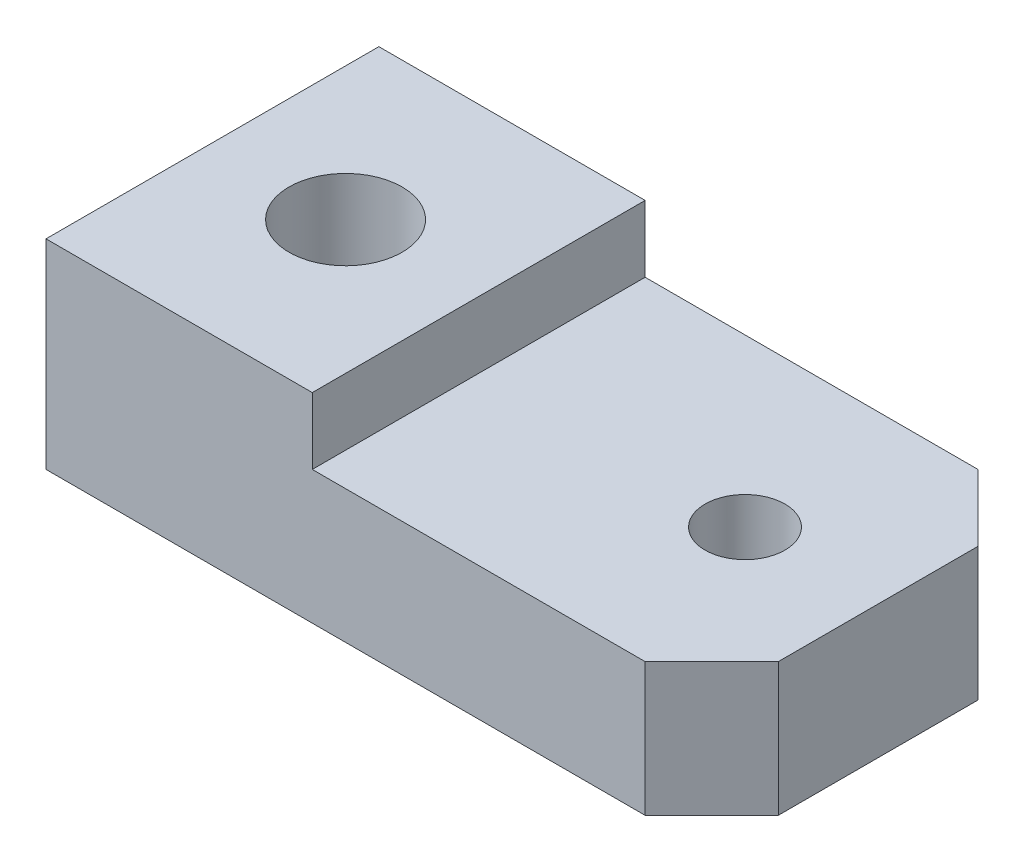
ISO-10303-21;
HEADER;
FILE_DESCRIPTION(('STEP AP214'),'2;1');
FILE_NAME('part.step','',(''),(''),'','','');
FILE_SCHEMA(('AUTOMOTIVE_DESIGN { 1 0 10303 214 1 1 1 1 }'));
ENDSEC;
DATA;
#1=APPLICATION_CONTEXT('core data for automotive mechanical design processes');
#2=APPLICATION_PROTOCOL_DEFINITION('international standard','automotive_design',2000,#1);
#3=PRODUCT_CONTEXT('',#1,'mechanical');
#4=PRODUCT('Part','Part','',(#3));
#5=PRODUCT_RELATED_PRODUCT_CATEGORY('part','',(#4));
#6=PRODUCT_DEFINITION_FORMATION('','',#4);
#7=PRODUCT_DEFINITION_CONTEXT('part definition',#1,'design');
#8=PRODUCT_DEFINITION('design','',#6,#7);
#9=PRODUCT_DEFINITION_SHAPE('','',#8);
#10=(LENGTH_UNIT() NAMED_UNIT(*) SI_UNIT(.MILLI.,.METRE.));
#11=(NAMED_UNIT(*) PLANE_ANGLE_UNIT() SI_UNIT($,.RADIAN.));
#12=(NAMED_UNIT(*) SI_UNIT($,.STERADIAN.) SOLID_ANGLE_UNIT());
#13=UNCERTAINTY_MEASURE_WITH_UNIT(LENGTH_MEASURE(1.E-05),#10,'distance_accuracy_value','');
#14=(GEOMETRIC_REPRESENTATION_CONTEXT(3) GLOBAL_UNCERTAINTY_ASSIGNED_CONTEXT((#13)) GLOBAL_UNIT_ASSIGNED_CONTEXT((#10,
#11,#12)) REPRESENTATION_CONTEXT('',''));
#15=CARTESIAN_POINT('',(0.,0.,0.));
#16=DIRECTION('',(0.,0.,1.));
#17=DIRECTION('',(1.,0.,0.));
#18=AXIS2_PLACEMENT_3D('',#15,#16,#17);
#19=CARTESIAN_POINT('',(-50.,15.,25.));
#20=DIRECTION('',(1.,0.,0.));
#21=DIRECTION('',(0.,0.,-1.));
#22=AXIS2_PLACEMENT_3D('',#19,#20,#21);
#23=PLANE('',#22);
#24=DIRECTION('',(0.,-1.,0.));
#25=VECTOR('',#24,1.);
#26=CARTESIAN_POINT('',(-50.,15.,0.));
#27=LINE('',#26,#25);
#28=CARTESIAN_POINT('',(-50.,15.,0.));
#29=VERTEX_POINT('',#28);
#30=CARTESIAN_POINT('',(-50.,0.,0.));
#31=VERTEX_POINT('',#30);
#32=EDGE_CURVE('E95',#29,#31,#27,.T.);
#33=ORIENTED_EDGE('',*,*,#32,.T.);
#34=DIRECTION('',(0.,0.,-1.));
#35=VECTOR('',#34,1.);
#36=CARTESIAN_POINT('',(-50.,0.,25.));
#37=LINE('',#36,#35);
#38=CARTESIAN_POINT('',(-50.,0.,25.));
#39=VERTEX_POINT('',#38);
#40=EDGE_CURVE('E99',#39,#31,#37,.T.);
#41=ORIENTED_EDGE('',*,*,#40,.F.);
#42=DIRECTION('',(0.,-1.,0.));
#43=VECTOR('',#42,1.);
#44=CARTESIAN_POINT('',(-50.,15.,25.));
#45=LINE('',#44,#43);
#46=CARTESIAN_POINT('',(-50.,15.,25.));
#47=VERTEX_POINT('',#46);
#48=EDGE_CURVE('E124',#47,#39,#45,.T.);
#49=ORIENTED_EDGE('',*,*,#48,.F.);
#50=DIRECTION('',(0.,0.,-1.));
#51=VECTOR('',#50,1.);
#52=CARTESIAN_POINT('',(-50.,15.,25.));
#53=LINE('',#52,#51);
#54=EDGE_CURVE('E111',#47,#29,#53,.T.);
#55=ORIENTED_EDGE('',*,*,#54,.T.);
#56=EDGE_LOOP('',(#33,#41,#49,#55));
#57=FACE_BOUND('',#56,.T.);
#58=ADVANCED_FACE('F28',(#57),#23,.F.);
#59=CARTESIAN_POINT('',(-50.,0.,25.));
#60=DIRECTION('',(0.,1.,0.));
#61=DIRECTION('',(0.,0.,1.));
#62=AXIS2_PLACEMENT_3D('',#59,#60,#61);
#63=PLANE('',#62);
#64=CARTESIAN_POINT('',(-10.,0.,12.5));
#65=DIRECTION('',(0.,-1.,0.));
#66=DIRECTION('',(0.,0.,-1.));
#67=AXIS2_PLACEMENT_3D('',#64,#65,#66);
#68=CIRCLE('',#67,3.);
#69=CARTESIAN_POINT('',(-10.,0.,9.50000000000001));
#70=VERTEX_POINT('',#69);
#71=EDGE_CURVE('E147',#70,#70,#68,.T.);
#72=ORIENTED_EDGE('',*,*,#71,.F.);
#73=EDGE_LOOP('',(#72));
#74=FACE_BOUND('',#73,.T.);
#75=CARTESIAN_POINT('',(-40.,0.,12.5));
#76=DIRECTION('',(0.,-1.,0.));
#77=DIRECTION('',(0.,0.,-1.));
#78=AXIS2_PLACEMENT_3D('',#75,#76,#77);
#79=CIRCLE('',#78,4.25);
#80=CARTESIAN_POINT('',(-40.,0.,8.25));
#81=VERTEX_POINT('',#80);
#82=EDGE_CURVE('E112',#81,#81,#79,.T.);
#83=ORIENTED_EDGE('',*,*,#82,.F.);
#84=EDGE_LOOP('',(#83));
#85=FACE_BOUND('',#84,.T.);
#86=DIRECTION('',(0.,0.,-1.));
#87=VECTOR('',#86,1.);
#88=CARTESIAN_POINT('',(0.,0.,25.));
#89=LINE('',#88,#87);
#90=CARTESIAN_POINT('',(0.,0.,19.9999999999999));
#91=VERTEX_POINT('',#90);
#92=CARTESIAN_POINT('',(0.,0.,5.00000000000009));
#93=VERTEX_POINT('',#92);
#94=EDGE_CURVE('E107',#91,#93,#89,.T.);
#95=ORIENTED_EDGE('',*,*,#94,.F.);
#96=DIRECTION('',(-0.707106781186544,0.,0.707106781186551));
#97=VECTOR('',#96,1.);
#98=CARTESIAN_POINT('',(-5.00000000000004,0.,25.));
#99=LINE('',#98,#97);
#100=CARTESIAN_POINT('',(-5.00000000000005,0.,25.));
#101=VERTEX_POINT('',#100);
#102=EDGE_CURVE('E35',#91,#101,#99,.T.);
#103=ORIENTED_EDGE('',*,*,#102,.T.);
#104=DIRECTION('',(1.,0.,0.));
#105=VECTOR('',#104,1.);
#106=CARTESIAN_POINT('',(-50.,0.,25.));
#107=LINE('',#106,#105);
#108=EDGE_CURVE('E102',#39,#101,#107,.T.);
#109=ORIENTED_EDGE('',*,*,#108,.F.);
#110=ORIENTED_EDGE('',*,*,#40,.T.);
#111=DIRECTION('',(1.,0.,0.));
#112=VECTOR('',#111,1.);
#113=CARTESIAN_POINT('',(-50.,0.,0.));
#114=LINE('',#113,#112);
#115=CARTESIAN_POINT('',(-5.00000000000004,0.,0.));
#116=VERTEX_POINT('',#115);
#117=EDGE_CURVE('E90',#31,#116,#114,.T.);
#118=ORIENTED_EDGE('',*,*,#117,.T.);
#119=DIRECTION('',(-0.707106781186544,0.,-0.707106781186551));
#120=VECTOR('',#119,1.);
#121=CARTESIAN_POINT('',(0.,0.,5.00000000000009));
#122=LINE('',#121,#120);
#123=EDGE_CURVE('E47',#116,#93,#122,.F.);
#124=ORIENTED_EDGE('',*,*,#123,.T.);
#125=EDGE_LOOP('',(#95,#103,#109,#110,#118,#124));
#126=FACE_BOUND('',#125,.T.);
#127=ADVANCED_FACE('F100',(#74,#85,#126),#63,.F.);
#128=CARTESIAN_POINT('',(0.,0.,25.));
#129=DIRECTION('',(-1.,0.,0.));
#130=DIRECTION('',(0.,0.,1.));
#131=AXIS2_PLACEMENT_3D('',#128,#129,#130);
#132=PLANE('',#131);
#133=DIRECTION('',(0.,0.,-1.));
#134=VECTOR('',#133,1.);
#135=CARTESIAN_POINT('',(0.,10.,25.));
#136=LINE('',#135,#134);
#137=CARTESIAN_POINT('',(0.,10.,19.9999999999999));
#138=VERTEX_POINT('',#137);
#139=CARTESIAN_POINT('',(0.,10.,5.00000000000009));
#140=VERTEX_POINT('',#139);
#141=EDGE_CURVE('E140',#138,#140,#136,.T.);
#142=ORIENTED_EDGE('',*,*,#141,.F.);
#143=DIRECTION('',(0.,-1.,0.));
#144=VECTOR('',#143,1.);
#145=CARTESIAN_POINT('',(0.,0.,19.9999999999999));
#146=LINE('',#145,#144);
#147=EDGE_CURVE('E157',#138,#91,#146,.T.);
#148=ORIENTED_EDGE('',*,*,#147,.T.);
#149=ORIENTED_EDGE('',*,*,#94,.T.);
#150=DIRECTION('',(0.,1.,0.));
#151=VECTOR('',#150,1.);
#152=CARTESIAN_POINT('',(0.,0.,5.00000000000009));
#153=LINE('',#152,#151);
#154=EDGE_CURVE('E154',#93,#140,#153,.T.);
#155=ORIENTED_EDGE('',*,*,#154,.T.);
#156=EDGE_LOOP('',(#142,#148,#149,#155));
#157=FACE_BOUND('',#156,.T.);
#158=ADVANCED_FACE('F172',(#157),#132,.F.);
#159=CARTESIAN_POINT('',(0.,10.,25.));
#160=DIRECTION('',(0.,-1.,0.));
#161=DIRECTION('',(1.,0.,0.));
#162=AXIS2_PLACEMENT_3D('',#159,#160,#161);
#163=PLANE('',#162);
#164=CARTESIAN_POINT('',(-10.,10.,12.5));
#165=DIRECTION('',(0.,-1.,0.));
#166=DIRECTION('',(1.,0.,0.));
#167=AXIS2_PLACEMENT_3D('',#164,#165,#166);
#168=CIRCLE('',#167,2.99999999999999);
#169=CARTESIAN_POINT('',(-7.00000000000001,10.,12.5));
#170=VERTEX_POINT('',#169);
#171=EDGE_CURVE('E144',#170,#170,#168,.T.);
#172=ORIENTED_EDGE('',*,*,#171,.T.);
#173=EDGE_LOOP('',(#172));
#174=FACE_BOUND('',#173,.T.);
#175=DIRECTION('',(-1.,0.,0.));
#176=VECTOR('',#175,1.);
#177=CARTESIAN_POINT('',(0.,10.,25.));
#178=LINE('',#177,#176);
#179=CARTESIAN_POINT('',(-5.00000000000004,10.,25.));
#180=VERTEX_POINT('',#179);
#181=CARTESIAN_POINT('',(-30.,10.,25.));
#182=VERTEX_POINT('',#181);
#183=EDGE_CURVE('E127',#180,#182,#178,.T.);
#184=ORIENTED_EDGE('',*,*,#183,.F.);
#185=DIRECTION('',(0.707106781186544,0.,-0.707106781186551));
#186=VECTOR('',#185,1.);
#187=CARTESIAN_POINT('',(-5.00000000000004,10.,25.));
#188=LINE('',#187,#186);
#189=EDGE_CURVE('E152',#180,#138,#188,.T.);
#190=ORIENTED_EDGE('',*,*,#189,.T.);
#191=ORIENTED_EDGE('',*,*,#141,.T.);
#192=DIRECTION('',(0.707106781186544,0.,0.707106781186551));
#193=VECTOR('',#192,1.);
#194=CARTESIAN_POINT('',(0.,10.,5.00000000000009));
#195=LINE('',#194,#193);
#196=CARTESIAN_POINT('',(-5.00000000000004,10.,0.));
#197=VERTEX_POINT('',#196);
#198=EDGE_CURVE('E150',#140,#197,#195,.F.);
#199=ORIENTED_EDGE('',*,*,#198,.T.);
#200=DIRECTION('',(-1.,0.,0.));
#201=VECTOR('',#200,1.);
#202=CARTESIAN_POINT('',(0.,10.,0.));
#203=LINE('',#202,#201);
#204=CARTESIAN_POINT('',(-30.,10.,0.));
#205=VERTEX_POINT('',#204);
#206=EDGE_CURVE('E96',#197,#205,#203,.T.);
#207=ORIENTED_EDGE('',*,*,#206,.T.);
#208=DIRECTION('',(0.,0.,-1.));
#209=VECTOR('',#208,1.);
#210=CARTESIAN_POINT('',(-30.,10.,25.));
#211=LINE('',#210,#209);
#212=EDGE_CURVE('E137',#182,#205,#211,.T.);
#213=ORIENTED_EDGE('',*,*,#212,.F.);
#214=EDGE_LOOP('',(#184,#190,#191,#199,#207,#213));
#215=FACE_BOUND('',#214,.T.);
#216=ADVANCED_FACE('F169',(#174,#215),#163,.F.);
#217=CARTESIAN_POINT('',(-30.,10.,25.));
#218=DIRECTION('',(-1.,0.,0.));
#219=DIRECTION('',(0.,0.,1.));
#220=AXIS2_PLACEMENT_3D('',#217,#218,#219);
#221=PLANE('',#220);
#222=DIRECTION('',(0.,1.,0.));
#223=VECTOR('',#222,1.);
#224=CARTESIAN_POINT('',(-30.,10.,0.));
#225=LINE('',#224,#223);
#226=CARTESIAN_POINT('',(-30.,15.,0.));
#227=VERTEX_POINT('',#226);
#228=EDGE_CURVE('E120',#205,#227,#225,.T.);
#229=ORIENTED_EDGE('',*,*,#228,.T.);
#230=DIRECTION('',(0.,0.,-1.));
#231=VECTOR('',#230,1.);
#232=CARTESIAN_POINT('',(-30.,15.,25.));
#233=LINE('',#232,#231);
#234=CARTESIAN_POINT('',(-30.,15.,25.));
#235=VERTEX_POINT('',#234);
#236=EDGE_CURVE('E134',#235,#227,#233,.T.);
#237=ORIENTED_EDGE('',*,*,#236,.F.);
#238=DIRECTION('',(0.,1.,0.));
#239=VECTOR('',#238,1.);
#240=CARTESIAN_POINT('',(-30.,10.,25.));
#241=LINE('',#240,#239);
#242=EDGE_CURVE('E129',#182,#235,#241,.T.);
#243=ORIENTED_EDGE('',*,*,#242,.F.);
#244=ORIENTED_EDGE('',*,*,#212,.T.);
#245=EDGE_LOOP('',(#229,#237,#243,#244));
#246=FACE_BOUND('',#245,.T.);
#247=ADVANCED_FACE('F179',(#246),#221,.F.);
#248=CARTESIAN_POINT('',(-30.,15.,25.));
#249=DIRECTION('',(0.,-1.,0.));
#250=DIRECTION('',(1.,0.,0.));
#251=AXIS2_PLACEMENT_3D('',#248,#249,#250);
#252=PLANE('',#251);
#253=CARTESIAN_POINT('',(-40.,15.,12.5));
#254=DIRECTION('',(0.,-1.,0.));
#255=DIRECTION('',(0.,0.,-1.));
#256=AXIS2_PLACEMENT_3D('',#253,#254,#255);
#257=CIRCLE('',#256,4.25);
#258=CARTESIAN_POINT('',(-40.,15.,8.25));
#259=VERTEX_POINT('',#258);
#260=EDGE_CURVE('E115',#259,#259,#257,.T.);
#261=ORIENTED_EDGE('',*,*,#260,.T.);
#262=EDGE_LOOP('',(#261));
#263=FACE_BOUND('',#262,.T.);
#264=DIRECTION('',(-1.,0.,0.));
#265=VECTOR('',#264,1.);
#266=CARTESIAN_POINT('',(-30.,15.,0.));
#267=LINE('',#266,#265);
#268=EDGE_CURVE('E122',#227,#29,#267,.T.);
#269=ORIENTED_EDGE('',*,*,#268,.T.);
#270=ORIENTED_EDGE('',*,*,#54,.F.);
#271=DIRECTION('',(-1.,0.,0.));
#272=VECTOR('',#271,1.);
#273=CARTESIAN_POINT('',(-30.,15.,25.));
#274=LINE('',#273,#272);
#275=EDGE_CURVE('E131',#235,#47,#274,.T.);
#276=ORIENTED_EDGE('',*,*,#275,.F.);
#277=ORIENTED_EDGE('',*,*,#236,.T.);
#278=EDGE_LOOP('',(#269,#270,#276,#277));
#279=FACE_BOUND('',#278,.T.);
#280=ADVANCED_FACE('F183',(#263,#279),#252,.F.);
#281=CARTESIAN_POINT('',(-50.,0.,25.));
#282=DIRECTION('',(0.,0.,1.));
#283=DIRECTION('',(1.,0.,0.));
#284=AXIS2_PLACEMENT_3D('',#281,#282,#283);
#285=PLANE('',#284);
#286=ORIENTED_EDGE('',*,*,#108,.T.);
#287=DIRECTION('',(0.,1.,0.));
#288=VECTOR('',#287,1.);
#289=CARTESIAN_POINT('',(-5.00000000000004,10.,25.));
#290=LINE('',#289,#288);
#291=EDGE_CURVE('E106',#101,#180,#290,.T.);
#292=ORIENTED_EDGE('',*,*,#291,.T.);
#293=ORIENTED_EDGE('',*,*,#183,.T.);
#294=ORIENTED_EDGE('',*,*,#242,.T.);
#295=ORIENTED_EDGE('',*,*,#275,.T.);
#296=ORIENTED_EDGE('',*,*,#48,.T.);
#297=EDGE_LOOP('',(#286,#292,#293,#294,#295,#296));
#298=FACE_BOUND('',#297,.T.);
#299=ADVANCED_FACE('F164',(#298),#285,.T.);
#300=CARTESIAN_POINT('',(-50.,0.,0.));
#301=DIRECTION('',(0.,0.,1.));
#302=DIRECTION('',(1.,0.,0.));
#303=AXIS2_PLACEMENT_3D('',#300,#301,#302);
#304=PLANE('',#303);
#305=ORIENTED_EDGE('',*,*,#206,.F.);
#306=DIRECTION('',(0.,-1.,0.));
#307=VECTOR('',#306,1.);
#308=CARTESIAN_POINT('',(-5.00000000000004,0.,0.));
#309=LINE('',#308,#307);
#310=EDGE_CURVE('E11',#197,#116,#309,.T.);
#311=ORIENTED_EDGE('',*,*,#310,.T.);
#312=ORIENTED_EDGE('',*,*,#117,.F.);
#313=ORIENTED_EDGE('',*,*,#32,.F.);
#314=ORIENTED_EDGE('',*,*,#268,.F.);
#315=ORIENTED_EDGE('',*,*,#228,.F.);
#316=EDGE_LOOP('',(#305,#311,#312,#313,#314,#315));
#317=FACE_BOUND('',#316,.T.);
#318=ADVANCED_FACE('F92',(#317),#304,.F.);
#319=CARTESIAN_POINT('',(-40.,0.,12.5));
#320=DIRECTION('',(0.,-1.,0.));
#321=DIRECTION('',(0.,0.,-1.));
#322=AXIS2_PLACEMENT_3D('',#319,#320,#321);
#323=CYLINDRICAL_SURFACE('',#322,4.25);
#324=ORIENTED_EDGE('',*,*,#260,.F.);
#325=EDGE_LOOP('',(#324));
#326=FACE_BOUND('',#325,.T.);
#327=ORIENTED_EDGE('',*,*,#82,.T.);
#328=EDGE_LOOP('',(#327));
#329=FACE_BOUND('',#328,.T.);
#330=ADVANCED_FACE('F214',(#326,#329),#323,.F.);
#331=CARTESIAN_POINT('',(-10.,0.,12.5));
#332=DIRECTION('',(0.,-1.,0.));
#333=DIRECTION('',(0.,0.,-1.));
#334=AXIS2_PLACEMENT_3D('',#331,#332,#333);
#335=CYLINDRICAL_SURFACE('',#334,2.99999999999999);
#336=ORIENTED_EDGE('',*,*,#71,.T.);
#337=EDGE_LOOP('',(#336));
#338=FACE_BOUND('',#337,.T.);
#339=ORIENTED_EDGE('',*,*,#171,.F.);
#340=EDGE_LOOP('',(#339));
#341=FACE_BOUND('',#340,.T.);
#342=ADVANCED_FACE('F212',(#338,#341),#335,.F.);
#343=CARTESIAN_POINT('',(-5.00000000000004,0.,25.));
#344=DIRECTION('',(0.707106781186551,0.,0.707106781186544));
#345=DIRECTION('',(0.707106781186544,0.,-0.707106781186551));
#346=AXIS2_PLACEMENT_3D('',#343,#344,#345);
#347=PLANE('',#346);
#348=ORIENTED_EDGE('',*,*,#102,.F.);
#349=ORIENTED_EDGE('',*,*,#147,.F.);
#350=ORIENTED_EDGE('',*,*,#189,.F.);
#351=ORIENTED_EDGE('',*,*,#291,.F.);
#352=EDGE_LOOP('',(#348,#349,#350,#351));
#353=FACE_BOUND('',#352,.T.);
#354=ADVANCED_FACE('F166',(#353),#347,.T.);
#355=CARTESIAN_POINT('',(0.,0.,5.00000000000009));
#356=DIRECTION('',(-0.707106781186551,0.,0.707106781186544));
#357=DIRECTION('',(0.707106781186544,0.,0.707106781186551));
#358=AXIS2_PLACEMENT_3D('',#355,#356,#357);
#359=PLANE('',#358);
#360=ORIENTED_EDGE('',*,*,#123,.F.);
#361=ORIENTED_EDGE('',*,*,#310,.F.);
#362=ORIENTED_EDGE('',*,*,#198,.F.);
#363=ORIENTED_EDGE('',*,*,#154,.F.);
#364=EDGE_LOOP('',(#360,#361,#362,#363));
#365=FACE_BOUND('',#364,.T.);
#366=ADVANCED_FACE('F175',(#365),#359,.F.);
#367=CLOSED_SHELL('',(#58,#127,#158,#216,#247,#280,#299,#318,#330,#342,#354,#366));
#368=MANIFOLD_SOLID_BREP('B2',#367);
#369=ADVANCED_BREP_SHAPE_REPRESENTATION('',(#18,#368),#14);
#370=SHAPE_DEFINITION_REPRESENTATION(#9,#369);
ENDSEC;
END-ISO-10303-21;
